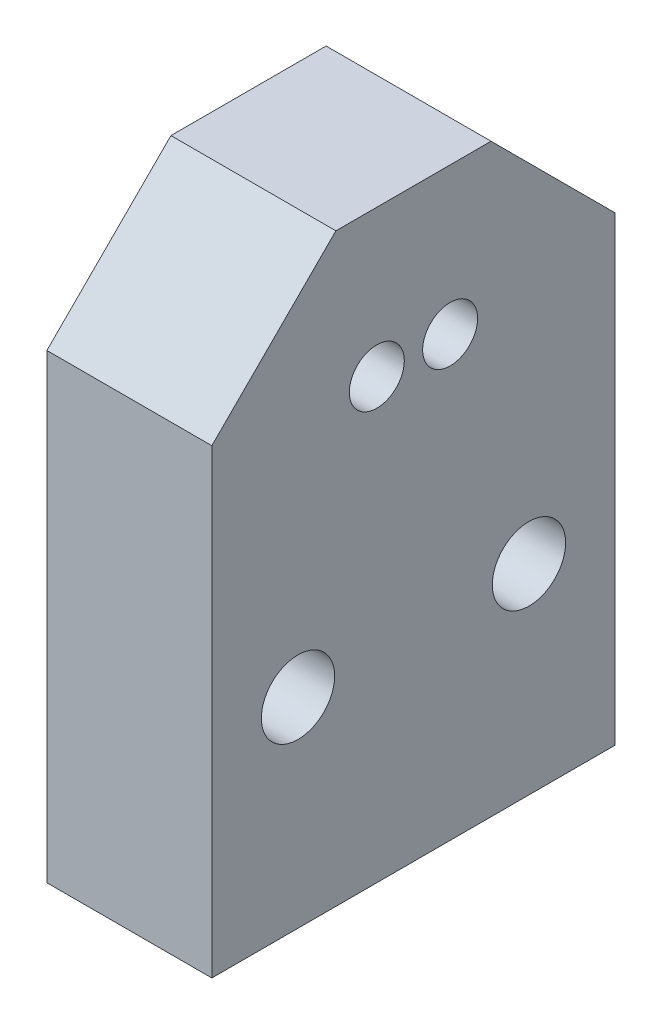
ISO-10303-21;
HEADER;
FILE_DESCRIPTION(('STEP AP214'),'2;1');
FILE_NAME('part.step','',(''),(''),'','','');
FILE_SCHEMA(('AUTOMOTIVE_DESIGN { 1 0 10303 214 1 1 1 1 }'));
ENDSEC;
DATA;
#1=APPLICATION_CONTEXT('core data for automotive mechanical design processes');
#2=APPLICATION_PROTOCOL_DEFINITION('international standard','automotive_design',2000,#1);
#3=PRODUCT_CONTEXT('',#1,'mechanical');
#4=PRODUCT('Part','Part','',(#3));
#5=PRODUCT_RELATED_PRODUCT_CATEGORY('part','',(#4));
#6=PRODUCT_DEFINITION_FORMATION('','',#4);
#7=PRODUCT_DEFINITION_CONTEXT('part definition',#1,'design');
#8=PRODUCT_DEFINITION('design','',#6,#7);
#9=PRODUCT_DEFINITION_SHAPE('','',#8);
#10=(LENGTH_UNIT() NAMED_UNIT(*) SI_UNIT(.MILLI.,.METRE.));
#11=(NAMED_UNIT(*) PLANE_ANGLE_UNIT() SI_UNIT($,.RADIAN.));
#12=(NAMED_UNIT(*) SI_UNIT($,.STERADIAN.) SOLID_ANGLE_UNIT());
#13=UNCERTAINTY_MEASURE_WITH_UNIT(LENGTH_MEASURE(1.E-05),#10,'distance_accuracy_value','');
#14=(GEOMETRIC_REPRESENTATION_CONTEXT(3) GLOBAL_UNCERTAINTY_ASSIGNED_CONTEXT((#13)) GLOBAL_UNIT_ASSIGNED_CONTEXT((#10,
#11,#12)) REPRESENTATION_CONTEXT('',''));
#15=CARTESIAN_POINT('',(0.,0.,0.));
#16=DIRECTION('',(0.,0.,1.));
#17=DIRECTION('',(1.,0.,0.));
#18=AXIS2_PLACEMENT_3D('',#15,#16,#17);
#19=CARTESIAN_POINT('',(9.,13.0798886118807,19.0815166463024));
#20=DIRECTION('',(0.,1.,0.));
#21=DIRECTION('',(0.,0.,1.));
#22=AXIS2_PLACEMENT_3D('',#19,#20,#21);
#23=PLANE('',#22);
#24=DIRECTION('',(0.,0.,-1.));
#25=VECTOR('',#24,1.);
#26=CARTESIAN_POINT('',(9.,13.0798886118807,19.0815166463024));
#27=LINE('',#26,#25);
#28=CARTESIAN_POINT('',(9.,13.0798886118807,16.6215166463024));
#29=VERTEX_POINT('',#28);
#30=CARTESIAN_POINT('',(9.,13.0798886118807,-5.38183435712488));
#31=VERTEX_POINT('',#30);
#32=EDGE_CURVE('E144',#29,#31,#27,.T.);
#33=ORIENTED_EDGE('',*,*,#32,.F.);
#34=DIRECTION('',(-1.,0.,0.));
#35=VECTOR('',#34,1.);
#36=CARTESIAN_POINT('',(9.,13.0798886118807,16.6215166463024));
#37=LINE('',#36,#35);
#38=CARTESIAN_POINT('',(0.,13.0798886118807,16.6215166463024));
#39=VERTEX_POINT('',#38);
#40=EDGE_CURVE('E100',#29,#39,#37,.T.);
#41=ORIENTED_EDGE('',*,*,#40,.T.);
#42=DIRECTION('',(0.,0.,-1.));
#43=VECTOR('',#42,1.);
#44=CARTESIAN_POINT('',(0.,13.0798886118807,19.0815166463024));
#45=LINE('',#44,#43);
#46=CARTESIAN_POINT('',(0.,13.0798886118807,-5.38183435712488));
#47=VERTEX_POINT('',#46);
#48=EDGE_CURVE('E132',#39,#47,#45,.T.);
#49=ORIENTED_EDGE('',*,*,#48,.T.);
#50=DIRECTION('',(1.,0.,0.));
#51=VECTOR('',#50,1.);
#52=CARTESIAN_POINT('',(9.,13.0798886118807,-5.38183435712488));
#53=LINE('',#52,#51);
#54=EDGE_CURVE('E69',#47,#31,#53,.T.);
#55=ORIENTED_EDGE('',*,*,#54,.T.);
#56=EDGE_LOOP('',(#33,#41,#49,#55));
#57=FACE_BOUND('',#56,.T.);
#58=ADVANCED_FACE('F47',(#57),#23,.F.);
#59=CARTESIAN_POINT('',(9.,45.,1.38664107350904));
#60=DIRECTION('',(0.,-0.707106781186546,0.707106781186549));
#61=DIRECTION('',(0.,-0.707106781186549,-0.707106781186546));
#62=AXIS2_PLACEMENT_3D('',#59,#60,#61);
#63=PLANE('',#62);
#64=DIRECTION('',(0.,0.707106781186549,0.707106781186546));
#65=VECTOR('',#64,1.);
#66=CARTESIAN_POINT('',(9.,45.,1.38664107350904));
#67=LINE('',#66,#65);
#68=CARTESIAN_POINT('',(9.,38.2315245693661,-5.38183435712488));
#69=VERTEX_POINT('',#68);
#70=CARTESIAN_POINT('',(9.,45.,1.38664107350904));
#71=VERTEX_POINT('',#70);
#72=EDGE_CURVE('E128',#69,#71,#67,.T.);
#73=ORIENTED_EDGE('',*,*,#72,.F.);
#74=DIRECTION('',(1.,0.,0.));
#75=VECTOR('',#74,1.);
#76=CARTESIAN_POINT('',(0.,38.2315245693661,-5.38183435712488));
#77=LINE('',#76,#75);
#78=CARTESIAN_POINT('',(0.,38.2315245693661,-5.38183435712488));
#79=VERTEX_POINT('',#78);
#80=EDGE_CURVE('E201',#79,#69,#77,.T.);
#81=ORIENTED_EDGE('',*,*,#80,.F.);
#82=DIRECTION('',(0.,0.707106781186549,0.707106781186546));
#83=VECTOR('',#82,1.);
#84=CARTESIAN_POINT('',(0.,45.,1.38664107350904));
#85=LINE('',#84,#83);
#86=CARTESIAN_POINT('',(0.,45.,1.38664107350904));
#87=VERTEX_POINT('',#86);
#88=EDGE_CURVE('E136',#79,#87,#85,.T.);
#89=ORIENTED_EDGE('',*,*,#88,.T.);
#90=DIRECTION('',(-1.,0.,0.));
#91=VECTOR('',#90,1.);
#92=CARTESIAN_POINT('',(9.,45.,1.38664107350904));
#93=LINE('',#92,#91);
#94=EDGE_CURVE('E55',#71,#87,#93,.T.);
#95=ORIENTED_EDGE('',*,*,#94,.F.);
#96=EDGE_LOOP('',(#73,#81,#89,#95));
#97=FACE_BOUND('',#96,.T.);
#98=ADVANCED_FACE('F200',(#97),#63,.F.);
#99=CARTESIAN_POINT('',(9.,45.,9.85304121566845));
#100=DIRECTION('',(0.,-1.,0.));
#101=DIRECTION('',(0.,0.,-1.));
#102=AXIS2_PLACEMENT_3D('',#99,#100,#101);
#103=PLANE('',#102);
#104=DIRECTION('',(0.,0.,1.));
#105=VECTOR('',#104,1.);
#106=CARTESIAN_POINT('',(0.,45.,9.85304121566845));
#107=LINE('',#106,#105);
#108=CARTESIAN_POINT('',(0.,45.,9.85304121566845));
#109=VERTEX_POINT('',#108);
#110=EDGE_CURVE('E140',#87,#109,#107,.T.);
#111=ORIENTED_EDGE('',*,*,#110,.T.);
#112=DIRECTION('',(-1.,0.,0.));
#113=VECTOR('',#112,1.);
#114=CARTESIAN_POINT('',(9.,45.,9.85304121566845));
#115=LINE('',#114,#113);
#116=CARTESIAN_POINT('',(9.,45.,9.85304121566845));
#117=VERTEX_POINT('',#116);
#118=EDGE_CURVE('E123',#117,#109,#115,.T.);
#119=ORIENTED_EDGE('',*,*,#118,.F.);
#120=DIRECTION('',(0.,0.,1.));
#121=VECTOR('',#120,1.);
#122=CARTESIAN_POINT('',(9.,45.,9.85304121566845));
#123=LINE('',#122,#121);
#124=EDGE_CURVE('E120',#71,#117,#123,.T.);
#125=ORIENTED_EDGE('',*,*,#124,.F.);
#126=ORIENTED_EDGE('',*,*,#94,.T.);
#127=EDGE_LOOP('',(#111,#119,#125,#126));
#128=FACE_BOUND('',#127,.T.);
#129=ADVANCED_FACE('F150',(#128),#103,.F.);
#130=CARTESIAN_POINT('',(9.,35.7715245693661,19.0815166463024));
#131=DIRECTION('',(0.,-0.707106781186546,-0.707106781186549));
#132=DIRECTION('',(0.,0.707106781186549,-0.707106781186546));
#133=AXIS2_PLACEMENT_3D('',#130,#131,#132);
#134=PLANE('',#133);
#135=DIRECTION('',(0.,-0.707106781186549,0.707106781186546));
#136=VECTOR('',#135,1.);
#137=CARTESIAN_POINT('',(0.,35.7715245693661,19.0815166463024));
#138=LINE('',#137,#136);
#139=CARTESIAN_POINT('',(0.,38.2315245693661,16.6215166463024));
#140=VERTEX_POINT('',#139);
#141=EDGE_CURVE('E115',#109,#140,#138,.T.);
#142=ORIENTED_EDGE('',*,*,#141,.T.);
#143=DIRECTION('',(1.,0.,0.));
#144=VECTOR('',#143,1.);
#145=CARTESIAN_POINT('',(0.,38.2315245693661,16.6215166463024));
#146=LINE('',#145,#144);
#147=CARTESIAN_POINT('',(9.,38.2315245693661,16.6215166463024));
#148=VERTEX_POINT('',#147);
#149=EDGE_CURVE('E61',#140,#148,#146,.T.);
#150=ORIENTED_EDGE('',*,*,#149,.T.);
#151=DIRECTION('',(0.,-0.707106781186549,0.707106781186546));
#152=VECTOR('',#151,1.);
#153=CARTESIAN_POINT('',(9.,35.7715245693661,19.0815166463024));
#154=LINE('',#153,#152);
#155=EDGE_CURVE('E113',#117,#148,#154,.T.);
#156=ORIENTED_EDGE('',*,*,#155,.F.);
#157=ORIENTED_EDGE('',*,*,#118,.T.);
#158=EDGE_LOOP('',(#142,#150,#156,#157));
#159=FACE_BOUND('',#158,.T.);
#160=ADVANCED_FACE('F111',(#159),#134,.F.);
#161=CARTESIAN_POINT('',(9.,0.,0.));
#162=DIRECTION('',(-1.,0.,0.));
#163=DIRECTION('',(0.,0.,1.));
#164=AXIS2_PLACEMENT_3D('',#161,#162,#163);
#165=PLANE('',#164);
#166=CARTESIAN_POINT('',(9.,24.,-0.680158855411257));
#167=DIRECTION('',(1.,0.,0.));
#168=DIRECTION('',(0.,0.,-1.));
#169=AXIS2_PLACEMENT_3D('',#166,#167,#168);
#170=CIRCLE('',#169,2.);
#171=CARTESIAN_POINT('',(9.,24.,-2.68015885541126));
#172=VERTEX_POINT('',#171);
#173=EDGE_CURVE('E173',#172,#172,#170,.T.);
#174=ORIENTED_EDGE('',*,*,#173,.F.);
#175=EDGE_LOOP('',(#174));
#176=FACE_BOUND('',#175,.T.);
#177=CARTESIAN_POINT('',(9.,37.,7.61984114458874));
#178=DIRECTION('',(1.,0.,0.));
#179=DIRECTION('',(0.,0.,-1.));
#180=AXIS2_PLACEMENT_3D('',#177,#178,#179);
#181=CIRCLE('',#180,1.5);
#182=CARTESIAN_POINT('',(9.,37.,6.11984114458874));
#183=VERTEX_POINT('',#182);
#184=EDGE_CURVE('E177',#183,#183,#181,.T.);
#185=ORIENTED_EDGE('',*,*,#184,.F.);
#186=EDGE_LOOP('',(#185));
#187=FACE_BOUND('',#186,.T.);
#188=CARTESIAN_POINT('',(9.,37.,3.61984114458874));
#189=DIRECTION('',(1.,0.,0.));
#190=DIRECTION('',(0.,0.,-1.));
#191=AXIS2_PLACEMENT_3D('',#188,#189,#190);
#192=CIRCLE('',#191,1.5);
#193=CARTESIAN_POINT('',(9.,37.,2.11984114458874));
#194=VERTEX_POINT('',#193);
#195=EDGE_CURVE('E185',#194,#194,#192,.T.);
#196=ORIENTED_EDGE('',*,*,#195,.F.);
#197=EDGE_LOOP('',(#196));
#198=FACE_BOUND('',#197,.T.);
#199=CARTESIAN_POINT('',(9.,24.,11.9198411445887));
#200=DIRECTION('',(1.,0.,0.));
#201=DIRECTION('',(0.,0.,-1.));
#202=AXIS2_PLACEMENT_3D('',#199,#200,#201);
#203=CIRCLE('',#202,2.00000000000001);
#204=CARTESIAN_POINT('',(9.,24.,9.91984114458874));
#205=VERTEX_POINT('',#204);
#206=EDGE_CURVE('E165',#205,#205,#203,.T.);
#207=ORIENTED_EDGE('',*,*,#206,.F.);
#208=EDGE_LOOP('',(#207));
#209=FACE_BOUND('',#208,.T.);
#210=ORIENTED_EDGE('',*,*,#155,.T.);
#211=DIRECTION('',(0.,1.,0.));
#212=VECTOR('',#211,1.);
#213=CARTESIAN_POINT('',(9.,38.2315245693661,16.6215166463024));
#214=LINE('',#213,#212);
#215=EDGE_CURVE('E97',#29,#148,#214,.T.);
#216=ORIENTED_EDGE('',*,*,#215,.F.);
#217=ORIENTED_EDGE('',*,*,#32,.T.);
#218=DIRECTION('',(0.,-1.,0.));
#219=VECTOR('',#218,1.);
#220=CARTESIAN_POINT('',(9.,12.3835102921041,-5.38183435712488));
#221=LINE('',#220,#219);
#222=EDGE_CURVE('E106',#69,#31,#221,.T.);
#223=ORIENTED_EDGE('',*,*,#222,.F.);
#224=ORIENTED_EDGE('',*,*,#72,.T.);
#225=ORIENTED_EDGE('',*,*,#124,.T.);
#226=EDGE_LOOP('',(#210,#216,#217,#223,#224,#225));
#227=FACE_BOUND('',#226,.T.);
#228=ADVANCED_FACE('F118',(#176,#187,#198,#209,#227),#165,.F.);
#229=CARTESIAN_POINT('',(0.,0.,0.));
#230=DIRECTION('',(-1.,0.,0.));
#231=DIRECTION('',(0.,0.,1.));
#232=AXIS2_PLACEMENT_3D('',#229,#230,#231);
#233=PLANE('',#232);
#234=DIRECTION('',(0.,-1.,0.));
#235=VECTOR('',#234,1.);
#236=CARTESIAN_POINT('',(0.,0.,16.6215166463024));
#237=LINE('',#236,#235);
#238=EDGE_CURVE('E11',#140,#39,#237,.T.);
#239=ORIENTED_EDGE('',*,*,#238,.F.);
#240=ORIENTED_EDGE('',*,*,#141,.F.);
#241=ORIENTED_EDGE('',*,*,#110,.F.);
#242=ORIENTED_EDGE('',*,*,#88,.F.);
#243=DIRECTION('',(0.,-1.,0.));
#244=VECTOR('',#243,1.);
#245=CARTESIAN_POINT('',(0.,38.2315245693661,-5.38183435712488));
#246=LINE('',#245,#244);
#247=EDGE_CURVE('E203',#79,#47,#246,.T.);
#248=ORIENTED_EDGE('',*,*,#247,.T.);
#249=ORIENTED_EDGE('',*,*,#48,.F.);
#250=EDGE_LOOP('',(#239,#240,#241,#242,#248,#249));
#251=FACE_BOUND('',#250,.T.);
#252=CARTESIAN_POINT('',(0.,24.,-0.680158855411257));
#253=DIRECTION('',(1.,0.,0.));
#254=DIRECTION('',(0.,0.,-1.));
#255=AXIS2_PLACEMENT_3D('',#252,#253,#254);
#256=CIRCLE('',#255,2.);
#257=CARTESIAN_POINT('',(0.,24.,-2.68015885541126));
#258=VERTEX_POINT('',#257);
#259=EDGE_CURVE('E137',#258,#258,#256,.T.);
#260=ORIENTED_EDGE('',*,*,#259,.T.);
#261=EDGE_LOOP('',(#260));
#262=FACE_BOUND('',#261,.T.);
#263=CARTESIAN_POINT('',(0.,37.,7.61984114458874));
#264=DIRECTION('',(1.,0.,0.));
#265=DIRECTION('',(0.,0.,-1.));
#266=AXIS2_PLACEMENT_3D('',#263,#264,#265);
#267=CIRCLE('',#266,1.5);
#268=CARTESIAN_POINT('',(0.,37.,6.11984114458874));
#269=VERTEX_POINT('',#268);
#270=EDGE_CURVE('E181',#269,#269,#267,.T.);
#271=ORIENTED_EDGE('',*,*,#270,.T.);
#272=EDGE_LOOP('',(#271));
#273=FACE_BOUND('',#272,.T.);
#274=CARTESIAN_POINT('',(0.,37.,3.61984114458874));
#275=DIRECTION('',(1.,0.,0.));
#276=DIRECTION('',(0.,0.,-1.));
#277=AXIS2_PLACEMENT_3D('',#274,#275,#276);
#278=CIRCLE('',#277,1.5);
#279=CARTESIAN_POINT('',(0.,37.,2.11984114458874));
#280=VERTEX_POINT('',#279);
#281=EDGE_CURVE('E189',#280,#280,#278,.T.);
#282=ORIENTED_EDGE('',*,*,#281,.T.);
#283=EDGE_LOOP('',(#282));
#284=FACE_BOUND('',#283,.T.);
#285=CARTESIAN_POINT('',(0.,24.,11.9198411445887));
#286=DIRECTION('',(1.,0.,0.));
#287=DIRECTION('',(0.,0.,-1.));
#288=AXIS2_PLACEMENT_3D('',#285,#286,#287);
#289=CIRCLE('',#288,2.00000000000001);
#290=CARTESIAN_POINT('',(0.,24.,9.91984114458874));
#291=VERTEX_POINT('',#290);
#292=EDGE_CURVE('E160',#291,#291,#289,.T.);
#293=ORIENTED_EDGE('',*,*,#292,.T.);
#294=EDGE_LOOP('',(#293));
#295=FACE_BOUND('',#294,.T.);
#296=ADVANCED_FACE('F155',(#251,#262,#273,#284,#295),#233,.T.);
#297=CARTESIAN_POINT('',(0.,24.,11.9198411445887));
#298=DIRECTION('',(1.,0.,0.));
#299=DIRECTION('',(0.,0.,-1.));
#300=AXIS2_PLACEMENT_3D('',#297,#298,#299);
#301=CYLINDRICAL_SURFACE('',#300,2.00000000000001);
#302=ORIENTED_EDGE('',*,*,#292,.F.);
#303=EDGE_LOOP('',(#302));
#304=FACE_BOUND('',#303,.T.);
#305=ORIENTED_EDGE('',*,*,#206,.T.);
#306=EDGE_LOOP('',(#305));
#307=FACE_BOUND('',#306,.T.);
#308=ADVANCED_FACE('F233',(#304,#307),#301,.F.);
#309=CARTESIAN_POINT('',(0.,37.,3.61984114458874));
#310=DIRECTION('',(1.,0.,0.));
#311=DIRECTION('',(0.,0.,-1.));
#312=AXIS2_PLACEMENT_3D('',#309,#310,#311);
#313=CYLINDRICAL_SURFACE('',#312,1.5);
#314=ORIENTED_EDGE('',*,*,#281,.F.);
#315=EDGE_LOOP('',(#314));
#316=FACE_BOUND('',#315,.T.);
#317=ORIENTED_EDGE('',*,*,#195,.T.);
#318=EDGE_LOOP('',(#317));
#319=FACE_BOUND('',#318,.T.);
#320=ADVANCED_FACE('F239',(#316,#319),#313,.F.);
#321=CARTESIAN_POINT('',(0.,37.,7.61984114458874));
#322=DIRECTION('',(1.,0.,0.));
#323=DIRECTION('',(0.,0.,-1.));
#324=AXIS2_PLACEMENT_3D('',#321,#322,#323);
#325=CYLINDRICAL_SURFACE('',#324,1.5);
#326=ORIENTED_EDGE('',*,*,#270,.F.);
#327=EDGE_LOOP('',(#326));
#328=FACE_BOUND('',#327,.T.);
#329=ORIENTED_EDGE('',*,*,#184,.T.);
#330=EDGE_LOOP('',(#329));
#331=FACE_BOUND('',#330,.T.);
#332=ADVANCED_FACE('F218',(#328,#331),#325,.F.);
#333=CARTESIAN_POINT('',(0.,24.,-0.680158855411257));
#334=DIRECTION('',(1.,0.,0.));
#335=DIRECTION('',(0.,0.,-1.));
#336=AXIS2_PLACEMENT_3D('',#333,#334,#335);
#337=CYLINDRICAL_SURFACE('',#336,2.);
#338=ORIENTED_EDGE('',*,*,#259,.F.);
#339=EDGE_LOOP('',(#338));
#340=FACE_BOUND('',#339,.T.);
#341=ORIENTED_EDGE('',*,*,#173,.T.);
#342=EDGE_LOOP('',(#341));
#343=FACE_BOUND('',#342,.T.);
#344=ADVANCED_FACE('F210',(#340,#343),#337,.F.);
#345=CARTESIAN_POINT('',(0.,12.3835102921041,-5.38183435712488));
#346=DIRECTION('',(0.,0.,1.));
#347=DIRECTION('',(1.,0.,0.));
#348=AXIS2_PLACEMENT_3D('',#345,#346,#347);
#349=PLANE('',#348);
#350=ORIENTED_EDGE('',*,*,#247,.F.);
#351=ORIENTED_EDGE('',*,*,#80,.T.);
#352=ORIENTED_EDGE('',*,*,#222,.T.);
#353=ORIENTED_EDGE('',*,*,#54,.F.);
#354=EDGE_LOOP('',(#350,#351,#352,#353));
#355=FACE_BOUND('',#354,.T.);
#356=ADVANCED_FACE('F208',(#355),#349,.F.);
#357=CARTESIAN_POINT('',(0.,38.2315245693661,16.6215166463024));
#358=DIRECTION('',(0.,0.,-1.));
#359=DIRECTION('',(0.,1.,0.));
#360=AXIS2_PLACEMENT_3D('',#357,#358,#359);
#361=PLANE('',#360);
#362=ORIENTED_EDGE('',*,*,#215,.T.);
#363=ORIENTED_EDGE('',*,*,#149,.F.);
#364=ORIENTED_EDGE('',*,*,#238,.T.);
#365=ORIENTED_EDGE('',*,*,#40,.F.);
#366=EDGE_LOOP('',(#362,#363,#364,#365));
#367=FACE_BOUND('',#366,.T.);
#368=ADVANCED_FACE('F98',(#367),#361,.F.);
#369=CLOSED_SHELL('',(#58,#98,#129,#160,#228,#296,#308,#320,#332,#344,#356,#368));
#370=MANIFOLD_SOLID_BREP('B2',#369);
#371=ADVANCED_BREP_SHAPE_REPRESENTATION('',(#18,#370),#14);
#372=SHAPE_DEFINITION_REPRESENTATION(#9,#371);
ENDSEC;
END-ISO-10303-21;
